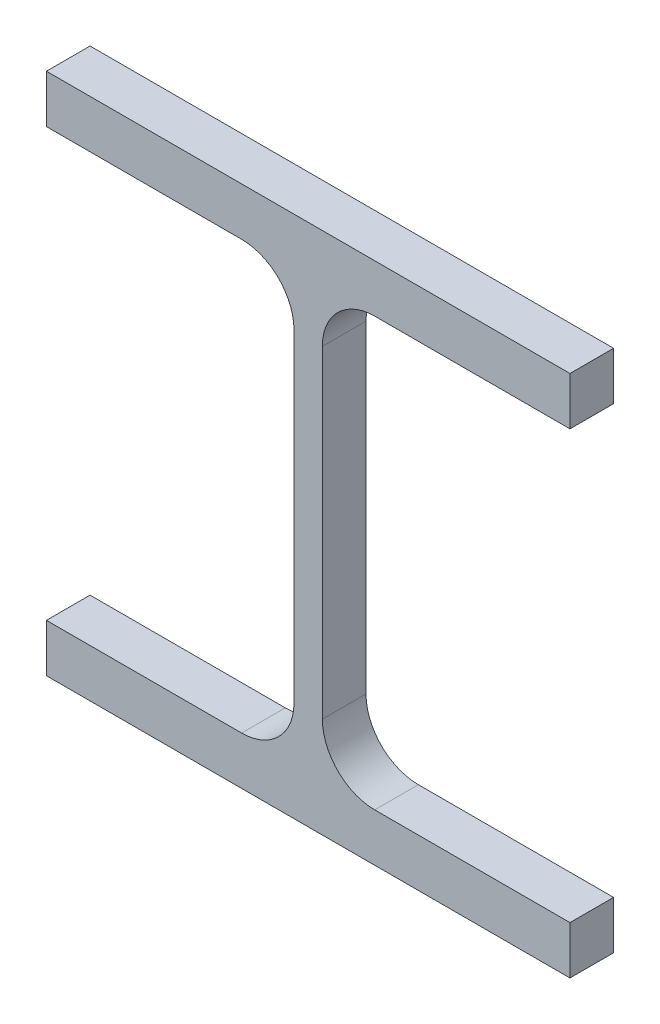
ISO-10303-21;
HEADER;
FILE_DESCRIPTION(('STEP AP214'),'2;1');
FILE_NAME('part.step','',(''),(''),'','','');
FILE_SCHEMA(('AUTOMOTIVE_DESIGN { 1 0 10303 214 1 1 1 1 }'));
ENDSEC;
DATA;
#1=APPLICATION_CONTEXT('core data for automotive mechanical design processes');
#2=APPLICATION_PROTOCOL_DEFINITION('international standard','automotive_design',2000,#1);
#3=PRODUCT_CONTEXT('',#1,'mechanical');
#4=PRODUCT('Part','Part','',(#3));
#5=PRODUCT_RELATED_PRODUCT_CATEGORY('part','',(#4));
#6=PRODUCT_DEFINITION_FORMATION('','',#4);
#7=PRODUCT_DEFINITION_CONTEXT('part definition',#1,'design');
#8=PRODUCT_DEFINITION('design','',#6,#7);
#9=PRODUCT_DEFINITION_SHAPE('','',#8);
#10=(LENGTH_UNIT() NAMED_UNIT(*) SI_UNIT(.MILLI.,.METRE.));
#11=(NAMED_UNIT(*) PLANE_ANGLE_UNIT() SI_UNIT($,.RADIAN.));
#12=(NAMED_UNIT(*) SI_UNIT($,.STERADIAN.) SOLID_ANGLE_UNIT());
#13=UNCERTAINTY_MEASURE_WITH_UNIT(LENGTH_MEASURE(1.E-05),#10,'distance_accuracy_value','');
#14=(GEOMETRIC_REPRESENTATION_CONTEXT(3) GLOBAL_UNCERTAINTY_ASSIGNED_CONTEXT((#13)) GLOBAL_UNIT_ASSIGNED_CONTEXT((#10,
#11,#12)) REPRESENTATION_CONTEXT('',''));
#15=CARTESIAN_POINT('',(0.,0.,0.));
#16=DIRECTION('',(0.,0.,1.));
#17=DIRECTION('',(1.,0.,0.));
#18=AXIS2_PLACEMENT_3D('',#15,#16,#17);
#19=CARTESIAN_POINT('',(-60.,-60.,10.));
#20=DIRECTION('',(1.,0.,0.));
#21=DIRECTION('',(0.,0.,-1.));
#22=AXIS2_PLACEMENT_3D('',#19,#20,#21);
#23=PLANE('',#22);
#24=DIRECTION('',(0.,-1.,0.));
#25=VECTOR('',#24,1.);
#26=CARTESIAN_POINT('',(-60.,-60.,0.));
#27=LINE('',#26,#25);
#28=CARTESIAN_POINT('',(-60.,-49.,0.));
#29=VERTEX_POINT('',#28);
#30=CARTESIAN_POINT('',(-60.,-60.,0.));
#31=VERTEX_POINT('',#30);
#32=EDGE_CURVE('E181',#29,#31,#27,.T.);
#33=ORIENTED_EDGE('',*,*,#32,.T.);
#34=DIRECTION('',(0.,0.,-1.));
#35=VECTOR('',#34,1.);
#36=CARTESIAN_POINT('',(-60.,-60.,10.));
#37=LINE('',#36,#35);
#38=CARTESIAN_POINT('',(-60.,-60.,10.));
#39=VERTEX_POINT('',#38);
#40=EDGE_CURVE('E11',#39,#31,#37,.T.);
#41=ORIENTED_EDGE('',*,*,#40,.F.);
#42=DIRECTION('',(0.,-1.,0.));
#43=VECTOR('',#42,1.);
#44=CARTESIAN_POINT('',(-60.,-60.,10.));
#45=LINE('',#44,#43);
#46=CARTESIAN_POINT('',(-60.,-49.,10.));
#47=VERTEX_POINT('',#46);
#48=EDGE_CURVE('E211',#47,#39,#45,.T.);
#49=ORIENTED_EDGE('',*,*,#48,.F.);
#50=DIRECTION('',(0.,0.,-1.));
#51=VECTOR('',#50,1.);
#52=CARTESIAN_POINT('',(-60.,-49.,10.));
#53=LINE('',#52,#51);
#54=EDGE_CURVE('E177',#47,#29,#53,.T.);
#55=ORIENTED_EDGE('',*,*,#54,.T.);
#56=EDGE_LOOP('',(#33,#41,#49,#55));
#57=FACE_BOUND('',#56,.T.);
#58=ADVANCED_FACE('F37',(#57),#23,.F.);
#59=CARTESIAN_POINT('',(60.,-60.,10.));
#60=DIRECTION('',(0.,1.,0.));
#61=DIRECTION('',(-1.,0.,0.));
#62=AXIS2_PLACEMENT_3D('',#59,#60,#61);
#63=PLANE('',#62);
#64=DIRECTION('',(1.,0.,0.));
#65=VECTOR('',#64,1.);
#66=CARTESIAN_POINT('',(60.,-60.,0.));
#67=LINE('',#66,#65);
#68=CARTESIAN_POINT('',(60.,-60.,0.));
#69=VERTEX_POINT('',#68);
#70=EDGE_CURVE('E184',#31,#69,#67,.T.);
#71=ORIENTED_EDGE('',*,*,#70,.T.);
#72=DIRECTION('',(0.,0.,-1.));
#73=VECTOR('',#72,1.);
#74=CARTESIAN_POINT('',(60.,-60.,10.));
#75=LINE('',#74,#73);
#76=CARTESIAN_POINT('',(60.,-60.,10.));
#77=VERTEX_POINT('',#76);
#78=EDGE_CURVE('E45',#77,#69,#75,.T.);
#79=ORIENTED_EDGE('',*,*,#78,.F.);
#80=DIRECTION('',(1.,0.,0.));
#81=VECTOR('',#80,1.);
#82=CARTESIAN_POINT('',(60.,-60.,10.));
#83=LINE('',#82,#81);
#84=EDGE_CURVE('E120',#39,#77,#83,.T.);
#85=ORIENTED_EDGE('',*,*,#84,.F.);
#86=ORIENTED_EDGE('',*,*,#40,.T.);
#87=EDGE_LOOP('',(#71,#79,#85,#86));
#88=FACE_BOUND('',#87,.T.);
#89=ADVANCED_FACE('F309',(#88),#63,.F.);
#90=CARTESIAN_POINT('',(60.,-60.,10.));
#91=DIRECTION('',(-1.,0.,0.));
#92=DIRECTION('',(0.,0.,1.));
#93=AXIS2_PLACEMENT_3D('',#90,#91,#92);
#94=PLANE('',#93);
#95=DIRECTION('',(0.,1.,0.));
#96=VECTOR('',#95,1.);
#97=CARTESIAN_POINT('',(60.,-60.,0.));
#98=LINE('',#97,#96);
#99=CARTESIAN_POINT('',(60.,-49.,0.));
#100=VERTEX_POINT('',#99);
#101=EDGE_CURVE('E186',#69,#100,#98,.T.);
#102=ORIENTED_EDGE('',*,*,#101,.T.);
#103=DIRECTION('',(0.,0.,-1.));
#104=VECTOR('',#103,1.);
#105=CARTESIAN_POINT('',(60.,-49.,10.));
#106=LINE('',#105,#104);
#107=CARTESIAN_POINT('',(60.,-49.,10.));
#108=VERTEX_POINT('',#107);
#109=EDGE_CURVE('E242',#108,#100,#106,.T.);
#110=ORIENTED_EDGE('',*,*,#109,.F.);
#111=DIRECTION('',(0.,1.,0.));
#112=VECTOR('',#111,1.);
#113=CARTESIAN_POINT('',(60.,-60.,10.));
#114=LINE('',#113,#112);
#115=EDGE_CURVE('E250',#77,#108,#114,.T.);
#116=ORIENTED_EDGE('',*,*,#115,.F.);
#117=ORIENTED_EDGE('',*,*,#78,.T.);
#118=EDGE_LOOP('',(#102,#110,#116,#117));
#119=FACE_BOUND('',#118,.T.);
#120=ADVANCED_FACE('F248',(#119),#94,.F.);
#121=CARTESIAN_POINT('',(60.,-49.,10.));
#122=DIRECTION('',(0.,-1.,0.));
#123=DIRECTION('',(1.,0.,0.));
#124=AXIS2_PLACEMENT_3D('',#121,#122,#123);
#125=PLANE('',#124);
#126=DIRECTION('',(-1.,0.,0.));
#127=VECTOR('',#126,1.);
#128=CARTESIAN_POINT('',(60.,-49.,0.));
#129=LINE('',#128,#127);
#130=CARTESIAN_POINT('',(15.25,-49.,0.));
#131=VERTEX_POINT('',#130);
#132=EDGE_CURVE('E188',#100,#131,#129,.T.);
#133=ORIENTED_EDGE('',*,*,#132,.T.);
#134=DIRECTION('',(0.,0.,-1.));
#135=VECTOR('',#134,1.);
#136=CARTESIAN_POINT('',(15.25,-49.,10.));
#137=LINE('',#136,#135);
#138=CARTESIAN_POINT('',(15.25,-49.,10.));
#139=VERTEX_POINT('',#138);
#140=EDGE_CURVE('E239',#139,#131,#137,.T.);
#141=ORIENTED_EDGE('',*,*,#140,.F.);
#142=DIRECTION('',(-1.,0.,0.));
#143=VECTOR('',#142,1.);
#144=CARTESIAN_POINT('',(60.,-49.,10.));
#145=LINE('',#144,#143);
#146=EDGE_CURVE('E268',#108,#139,#145,.T.);
#147=ORIENTED_EDGE('',*,*,#146,.F.);
#148=ORIENTED_EDGE('',*,*,#109,.T.);
#149=EDGE_LOOP('',(#133,#141,#147,#148));
#150=FACE_BOUND('',#149,.T.);
#151=ADVANCED_FACE('F259',(#150),#125,.F.);
#152=CARTESIAN_POINT('',(15.25,-37.,10.));
#153=DIRECTION('',(0.,0.,-1.));
#154=DIRECTION('',(-1.,0.,0.));
#155=AXIS2_PLACEMENT_3D('',#152,#153,#154);
#156=CYLINDRICAL_SURFACE('',#155,12.);
#157=CARTESIAN_POINT('',(15.25,-37.,0.));
#158=DIRECTION('',(0.,0.,-1.));
#159=DIRECTION('',(-1.,0.,0.));
#160=AXIS2_PLACEMENT_3D('',#157,#158,#159);
#161=CIRCLE('',#160,12.);
#162=CARTESIAN_POINT('',(3.25,-37.,0.));
#163=VERTEX_POINT('',#162);
#164=EDGE_CURVE('E190',#131,#163,#161,.T.);
#165=ORIENTED_EDGE('',*,*,#164,.T.);
#166=DIRECTION('',(0.,0.,-1.));
#167=VECTOR('',#166,1.);
#168=CARTESIAN_POINT('',(3.25,-37.,10.));
#169=LINE('',#168,#167);
#170=CARTESIAN_POINT('',(3.25,-37.,10.));
#171=VERTEX_POINT('',#170);
#172=EDGE_CURVE('E236',#171,#163,#169,.T.);
#173=ORIENTED_EDGE('',*,*,#172,.F.);
#174=CARTESIAN_POINT('',(15.25,-37.,10.));
#175=DIRECTION('',(0.,0.,-1.));
#176=DIRECTION('',(-1.,0.,0.));
#177=AXIS2_PLACEMENT_3D('',#174,#175,#176);
#178=CIRCLE('',#177,12.);
#179=EDGE_CURVE('E265',#139,#171,#178,.T.);
#180=ORIENTED_EDGE('',*,*,#179,.F.);
#181=ORIENTED_EDGE('',*,*,#140,.T.);
#182=EDGE_LOOP('',(#165,#173,#180,#181));
#183=FACE_BOUND('',#182,.T.);
#184=ADVANCED_FACE('F263',(#183),#156,.F.);
#185=CARTESIAN_POINT('',(3.24999999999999,-37.,10.));
#186=DIRECTION('',(-1.,0.,0.));
#187=DIRECTION('',(0.,0.,1.));
#188=AXIS2_PLACEMENT_3D('',#185,#186,#187);
#189=PLANE('',#188);
#190=DIRECTION('',(0.,1.,0.));
#191=VECTOR('',#190,1.);
#192=CARTESIAN_POINT('',(3.24999999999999,-37.,0.));
#193=LINE('',#192,#191);
#194=CARTESIAN_POINT('',(3.24999999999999,37.,0.));
#195=VERTEX_POINT('',#194);
#196=EDGE_CURVE('E192',#163,#195,#193,.T.);
#197=ORIENTED_EDGE('',*,*,#196,.T.);
#198=DIRECTION('',(0.,0.,-1.));
#199=VECTOR('',#198,1.);
#200=CARTESIAN_POINT('',(3.24999999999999,37.,10.));
#201=LINE('',#200,#199);
#202=CARTESIAN_POINT('',(3.24999999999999,37.,10.));
#203=VERTEX_POINT('',#202);
#204=EDGE_CURVE('E233',#203,#195,#201,.T.);
#205=ORIENTED_EDGE('',*,*,#204,.F.);
#206=DIRECTION('',(0.,1.,0.));
#207=VECTOR('',#206,1.);
#208=CARTESIAN_POINT('',(3.24999999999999,-37.,10.));
#209=LINE('',#208,#207);
#210=EDGE_CURVE('E267',#171,#203,#209,.T.);
#211=ORIENTED_EDGE('',*,*,#210,.F.);
#212=ORIENTED_EDGE('',*,*,#172,.T.);
#213=EDGE_LOOP('',(#197,#205,#211,#212));
#214=FACE_BOUND('',#213,.T.);
#215=ADVANCED_FACE('F322',(#214),#189,.F.);
#216=CARTESIAN_POINT('',(15.25,37.,10.));
#217=DIRECTION('',(0.,0.,-1.));
#218=DIRECTION('',(-1.,0.,0.));
#219=AXIS2_PLACEMENT_3D('',#216,#217,#218);
#220=CYLINDRICAL_SURFACE('',#219,12.);
#221=CARTESIAN_POINT('',(15.25,37.,0.));
#222=DIRECTION('',(0.,0.,-1.));
#223=DIRECTION('',(-1.,0.,0.));
#224=AXIS2_PLACEMENT_3D('',#221,#222,#223);
#225=CIRCLE('',#224,12.);
#226=CARTESIAN_POINT('',(15.25,49.,0.));
#227=VERTEX_POINT('',#226);
#228=EDGE_CURVE('E194',#195,#227,#225,.T.);
#229=ORIENTED_EDGE('',*,*,#228,.T.);
#230=DIRECTION('',(0.,0.,-1.));
#231=VECTOR('',#230,1.);
#232=CARTESIAN_POINT('',(15.25,49.,10.));
#233=LINE('',#232,#231);
#234=CARTESIAN_POINT('',(15.25,49.,10.));
#235=VERTEX_POINT('',#234);
#236=EDGE_CURVE('E230',#235,#227,#233,.T.);
#237=ORIENTED_EDGE('',*,*,#236,.F.);
#238=CARTESIAN_POINT('',(15.25,37.,10.));
#239=DIRECTION('',(0.,0.,-1.));
#240=DIRECTION('',(-1.,0.,0.));
#241=AXIS2_PLACEMENT_3D('',#238,#239,#240);
#242=CIRCLE('',#241,12.);
#243=EDGE_CURVE('E270',#203,#235,#242,.T.);
#244=ORIENTED_EDGE('',*,*,#243,.F.);
#245=ORIENTED_EDGE('',*,*,#204,.T.);
#246=EDGE_LOOP('',(#229,#237,#244,#245));
#247=FACE_BOUND('',#246,.T.);
#248=ADVANCED_FACE('F325',(#247),#220,.F.);
#249=CARTESIAN_POINT('',(15.25,49.,10.));
#250=DIRECTION('',(0.,1.,0.));
#251=DIRECTION('',(-1.,0.,0.));
#252=AXIS2_PLACEMENT_3D('',#249,#250,#251);
#253=PLANE('',#252);
#254=DIRECTION('',(1.,0.,0.));
#255=VECTOR('',#254,1.);
#256=CARTESIAN_POINT('',(15.25,49.,0.));
#257=LINE('',#256,#255);
#258=CARTESIAN_POINT('',(60.,49.,0.));
#259=VERTEX_POINT('',#258);
#260=EDGE_CURVE('E196',#227,#259,#257,.T.);
#261=ORIENTED_EDGE('',*,*,#260,.T.);
#262=DIRECTION('',(0.,0.,-1.));
#263=VECTOR('',#262,1.);
#264=CARTESIAN_POINT('',(60.,49.,10.));
#265=LINE('',#264,#263);
#266=CARTESIAN_POINT('',(60.,49.,10.));
#267=VERTEX_POINT('',#266);
#268=EDGE_CURVE('E227',#267,#259,#265,.T.);
#269=ORIENTED_EDGE('',*,*,#268,.F.);
#270=DIRECTION('',(1.,0.,0.));
#271=VECTOR('',#270,1.);
#272=CARTESIAN_POINT('',(15.25,49.,10.));
#273=LINE('',#272,#271);
#274=EDGE_CURVE('E276',#235,#267,#273,.T.);
#275=ORIENTED_EDGE('',*,*,#274,.F.);
#276=ORIENTED_EDGE('',*,*,#236,.T.);
#277=EDGE_LOOP('',(#261,#269,#275,#276));
#278=FACE_BOUND('',#277,.T.);
#279=ADVANCED_FACE('F329',(#278),#253,.F.);
#280=CARTESIAN_POINT('',(60.,49.,10.));
#281=DIRECTION('',(-1.,0.,0.));
#282=DIRECTION('',(0.,0.,1.));
#283=AXIS2_PLACEMENT_3D('',#280,#281,#282);
#284=PLANE('',#283);
#285=DIRECTION('',(0.,1.,0.));
#286=VECTOR('',#285,1.);
#287=CARTESIAN_POINT('',(60.,49.,0.));
#288=LINE('',#287,#286);
#289=CARTESIAN_POINT('',(60.,60.,0.));
#290=VERTEX_POINT('',#289);
#291=EDGE_CURVE('E198',#259,#290,#288,.T.);
#292=ORIENTED_EDGE('',*,*,#291,.T.);
#293=DIRECTION('',(0.,0.,-1.));
#294=VECTOR('',#293,1.);
#295=CARTESIAN_POINT('',(60.,60.,10.));
#296=LINE('',#295,#294);
#297=CARTESIAN_POINT('',(60.,60.,10.));
#298=VERTEX_POINT('',#297);
#299=EDGE_CURVE('E224',#298,#290,#296,.T.);
#300=ORIENTED_EDGE('',*,*,#299,.F.);
#301=DIRECTION('',(0.,1.,0.));
#302=VECTOR('',#301,1.);
#303=CARTESIAN_POINT('',(60.,49.,10.));
#304=LINE('',#303,#302);
#305=EDGE_CURVE('E278',#267,#298,#304,.T.);
#306=ORIENTED_EDGE('',*,*,#305,.F.);
#307=ORIENTED_EDGE('',*,*,#268,.T.);
#308=EDGE_LOOP('',(#292,#300,#306,#307));
#309=FACE_BOUND('',#308,.T.);
#310=ADVANCED_FACE('F333',(#309),#284,.F.);
#311=CARTESIAN_POINT('',(-60.,60.,10.));
#312=DIRECTION('',(0.,-1.,0.));
#313=DIRECTION('',(1.,0.,0.));
#314=AXIS2_PLACEMENT_3D('',#311,#312,#313);
#315=PLANE('',#314);
#316=DIRECTION('',(-1.,0.,0.));
#317=VECTOR('',#316,1.);
#318=CARTESIAN_POINT('',(-60.,60.,0.));
#319=LINE('',#318,#317);
#320=CARTESIAN_POINT('',(-60.,60.,0.));
#321=VERTEX_POINT('',#320);
#322=EDGE_CURVE('E200',#290,#321,#319,.T.);
#323=ORIENTED_EDGE('',*,*,#322,.T.);
#324=DIRECTION('',(0.,0.,-1.));
#325=VECTOR('',#324,1.);
#326=CARTESIAN_POINT('',(-60.,60.,10.));
#327=LINE('',#326,#325);
#328=CARTESIAN_POINT('',(-60.,60.,10.));
#329=VERTEX_POINT('',#328);
#330=EDGE_CURVE('E221',#329,#321,#327,.T.);
#331=ORIENTED_EDGE('',*,*,#330,.F.);
#332=DIRECTION('',(-1.,0.,0.));
#333=VECTOR('',#332,1.);
#334=CARTESIAN_POINT('',(-60.,60.,10.));
#335=LINE('',#334,#333);
#336=EDGE_CURVE('E280',#298,#329,#335,.T.);
#337=ORIENTED_EDGE('',*,*,#336,.F.);
#338=ORIENTED_EDGE('',*,*,#299,.T.);
#339=EDGE_LOOP('',(#323,#331,#337,#338));
#340=FACE_BOUND('',#339,.T.);
#341=ADVANCED_FACE('F337',(#340),#315,.F.);
#342=CARTESIAN_POINT('',(-60.,49.,10.));
#343=DIRECTION('',(1.,0.,0.));
#344=DIRECTION('',(0.,0.,-1.));
#345=AXIS2_PLACEMENT_3D('',#342,#343,#344);
#346=PLANE('',#345);
#347=DIRECTION('',(0.,-1.,0.));
#348=VECTOR('',#347,1.);
#349=CARTESIAN_POINT('',(-60.,49.,0.));
#350=LINE('',#349,#348);
#351=CARTESIAN_POINT('',(-60.,49.,0.));
#352=VERTEX_POINT('',#351);
#353=EDGE_CURVE('E202',#321,#352,#350,.T.);
#354=ORIENTED_EDGE('',*,*,#353,.T.);
#355=DIRECTION('',(0.,0.,-1.));
#356=VECTOR('',#355,1.);
#357=CARTESIAN_POINT('',(-60.,49.,10.));
#358=LINE('',#357,#356);
#359=CARTESIAN_POINT('',(-60.,49.,10.));
#360=VERTEX_POINT('',#359);
#361=EDGE_CURVE('E218',#360,#352,#358,.T.);
#362=ORIENTED_EDGE('',*,*,#361,.F.);
#363=DIRECTION('',(0.,-1.,0.));
#364=VECTOR('',#363,1.);
#365=CARTESIAN_POINT('',(-60.,49.,10.));
#366=LINE('',#365,#364);
#367=EDGE_CURVE('E282',#329,#360,#366,.T.);
#368=ORIENTED_EDGE('',*,*,#367,.F.);
#369=ORIENTED_EDGE('',*,*,#330,.T.);
#370=EDGE_LOOP('',(#354,#362,#368,#369));
#371=FACE_BOUND('',#370,.T.);
#372=ADVANCED_FACE('F341',(#371),#346,.F.);
#373=CARTESIAN_POINT('',(-15.25,49.,10.));
#374=DIRECTION('',(0.,1.,0.));
#375=DIRECTION('',(0.,0.,1.));
#376=AXIS2_PLACEMENT_3D('',#373,#374,#375);
#377=PLANE('',#376);
#378=DIRECTION('',(1.,0.,0.));
#379=VECTOR('',#378,1.);
#380=CARTESIAN_POINT('',(-15.25,49.,0.));
#381=LINE('',#380,#379);
#382=CARTESIAN_POINT('',(-15.25,49.,0.));
#383=VERTEX_POINT('',#382);
#384=EDGE_CURVE('E204',#352,#383,#381,.T.);
#385=ORIENTED_EDGE('',*,*,#384,.T.);
#386=DIRECTION('',(0.,0.,-1.));
#387=VECTOR('',#386,1.);
#388=CARTESIAN_POINT('',(-15.25,49.,10.));
#389=LINE('',#388,#387);
#390=CARTESIAN_POINT('',(-15.25,49.,10.));
#391=VERTEX_POINT('',#390);
#392=EDGE_CURVE('E215',#391,#383,#389,.T.);
#393=ORIENTED_EDGE('',*,*,#392,.F.);
#394=DIRECTION('',(1.,0.,0.));
#395=VECTOR('',#394,1.);
#396=CARTESIAN_POINT('',(-15.25,49.,10.));
#397=LINE('',#396,#395);
#398=EDGE_CURVE('E284',#360,#391,#397,.T.);
#399=ORIENTED_EDGE('',*,*,#398,.F.);
#400=ORIENTED_EDGE('',*,*,#361,.T.);
#401=EDGE_LOOP('',(#385,#393,#399,#400));
#402=FACE_BOUND('',#401,.T.);
#403=ADVANCED_FACE('F290',(#402),#377,.F.);
#404=CARTESIAN_POINT('',(-15.25,37.,10.));
#405=DIRECTION('',(0.,0.,-1.));
#406=DIRECTION('',(-1.,0.,0.));
#407=AXIS2_PLACEMENT_3D('',#404,#405,#406);
#408=CYLINDRICAL_SURFACE('',#407,12.);
#409=CARTESIAN_POINT('',(-15.25,37.,0.));
#410=DIRECTION('',(0.,0.,-1.));
#411=DIRECTION('',(1.,0.,0.));
#412=AXIS2_PLACEMENT_3D('',#409,#410,#411);
#413=CIRCLE('',#412,12.);
#414=CARTESIAN_POINT('',(-3.24999999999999,37.,0.));
#415=VERTEX_POINT('',#414);
#416=EDGE_CURVE('E206',#383,#415,#413,.T.);
#417=ORIENTED_EDGE('',*,*,#416,.T.);
#418=DIRECTION('',(0.,0.,-1.));
#419=VECTOR('',#418,1.);
#420=CARTESIAN_POINT('',(-3.24999999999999,37.,10.));
#421=LINE('',#420,#419);
#422=CARTESIAN_POINT('',(-3.24999999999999,37.,10.));
#423=VERTEX_POINT('',#422);
#424=EDGE_CURVE('E172',#423,#415,#421,.T.);
#425=ORIENTED_EDGE('',*,*,#424,.F.);
#426=CARTESIAN_POINT('',(-15.25,37.,10.));
#427=DIRECTION('',(0.,0.,-1.));
#428=DIRECTION('',(1.,0.,0.));
#429=AXIS2_PLACEMENT_3D('',#426,#427,#428);
#430=CIRCLE('',#429,12.);
#431=EDGE_CURVE('E163',#391,#423,#430,.T.);
#432=ORIENTED_EDGE('',*,*,#431,.F.);
#433=ORIENTED_EDGE('',*,*,#392,.T.);
#434=EDGE_LOOP('',(#417,#425,#432,#433));
#435=FACE_BOUND('',#434,.T.);
#436=ADVANCED_FACE('F294',(#435),#408,.F.);
#437=CARTESIAN_POINT('',(-3.24999999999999,-37.,10.));
#438=DIRECTION('',(1.,0.,0.));
#439=DIRECTION('',(0.,0.,-1.));
#440=AXIS2_PLACEMENT_3D('',#437,#438,#439);
#441=PLANE('',#440);
#442=DIRECTION('',(0.,-1.,0.));
#443=VECTOR('',#442,1.);
#444=CARTESIAN_POINT('',(-3.24999999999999,-37.,0.));
#445=LINE('',#444,#443);
#446=CARTESIAN_POINT('',(-3.24999999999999,-37.,0.));
#447=VERTEX_POINT('',#446);
#448=EDGE_CURVE('E171',#415,#447,#445,.T.);
#449=ORIENTED_EDGE('',*,*,#448,.T.);
#450=DIRECTION('',(0.,0.,-1.));
#451=VECTOR('',#450,1.);
#452=CARTESIAN_POINT('',(-3.24999999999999,-37.,10.));
#453=LINE('',#452,#451);
#454=CARTESIAN_POINT('',(-3.24999999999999,-37.,10.));
#455=VERTEX_POINT('',#454);
#456=EDGE_CURVE('E168',#455,#447,#453,.T.);
#457=ORIENTED_EDGE('',*,*,#456,.F.);
#458=DIRECTION('',(0.,-1.,0.));
#459=VECTOR('',#458,1.);
#460=CARTESIAN_POINT('',(-3.24999999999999,-37.,10.));
#461=LINE('',#460,#459);
#462=EDGE_CURVE('E157',#423,#455,#461,.T.);
#463=ORIENTED_EDGE('',*,*,#462,.F.);
#464=ORIENTED_EDGE('',*,*,#424,.T.);
#465=EDGE_LOOP('',(#449,#457,#463,#464));
#466=FACE_BOUND('',#465,.T.);
#467=ADVANCED_FACE('F169',(#466),#441,.F.);
#468=CARTESIAN_POINT('',(-15.25,-37.,10.));
#469=DIRECTION('',(0.,0.,-1.));
#470=DIRECTION('',(-1.,0.,0.));
#471=AXIS2_PLACEMENT_3D('',#468,#469,#470);
#472=CYLINDRICAL_SURFACE('',#471,12.);
#473=CARTESIAN_POINT('',(-15.25,-37.,0.));
#474=DIRECTION('',(0.,0.,-1.));
#475=DIRECTION('',(1.,0.,0.));
#476=AXIS2_PLACEMENT_3D('',#473,#474,#475);
#477=CIRCLE('',#476,12.);
#478=CARTESIAN_POINT('',(-15.25,-49.,0.));
#479=VERTEX_POINT('',#478);
#480=EDGE_CURVE('E106',#447,#479,#477,.T.);
#481=ORIENTED_EDGE('',*,*,#480,.T.);
#482=DIRECTION('',(0.,0.,-1.));
#483=VECTOR('',#482,1.);
#484=CARTESIAN_POINT('',(-15.25,-49.,10.));
#485=LINE('',#484,#483);
#486=CARTESIAN_POINT('',(-15.25,-49.,10.));
#487=VERTEX_POINT('',#486);
#488=EDGE_CURVE('E173',#487,#479,#485,.T.);
#489=ORIENTED_EDGE('',*,*,#488,.F.);
#490=CARTESIAN_POINT('',(-15.25,-37.,10.));
#491=DIRECTION('',(0.,0.,-1.));
#492=DIRECTION('',(1.,0.,0.));
#493=AXIS2_PLACEMENT_3D('',#490,#491,#492);
#494=CIRCLE('',#493,12.);
#495=EDGE_CURVE('E161',#455,#487,#494,.T.);
#496=ORIENTED_EDGE('',*,*,#495,.F.);
#497=ORIENTED_EDGE('',*,*,#456,.T.);
#498=EDGE_LOOP('',(#481,#489,#496,#497));
#499=FACE_BOUND('',#498,.T.);
#500=ADVANCED_FACE('F175',(#499),#472,.F.);
#501=CARTESIAN_POINT('',(-60.,-49.,10.));
#502=DIRECTION('',(0.,-1.,0.));
#503=DIRECTION('',(0.,0.,-1.));
#504=AXIS2_PLACEMENT_3D('',#501,#502,#503);
#505=PLANE('',#504);
#506=DIRECTION('',(-1.,0.,0.));
#507=VECTOR('',#506,1.);
#508=CARTESIAN_POINT('',(-60.,-49.,0.));
#509=LINE('',#508,#507);
#510=EDGE_CURVE('E112',#479,#29,#509,.T.);
#511=ORIENTED_EDGE('',*,*,#510,.T.);
#512=ORIENTED_EDGE('',*,*,#54,.F.);
#513=DIRECTION('',(-1.,0.,0.));
#514=VECTOR('',#513,1.);
#515=CARTESIAN_POINT('',(-60.,-49.,10.));
#516=LINE('',#515,#514);
#517=EDGE_CURVE('E53',#487,#47,#516,.T.);
#518=ORIENTED_EDGE('',*,*,#517,.F.);
#519=ORIENTED_EDGE('',*,*,#488,.T.);
#520=EDGE_LOOP('',(#511,#512,#518,#519));
#521=FACE_BOUND('',#520,.T.);
#522=ADVANCED_FACE('F298',(#521),#505,.F.);
#523=CARTESIAN_POINT('',(-15.25,-37.,10.));
#524=DIRECTION('',(0.,0.,1.));
#525=DIRECTION('',(1.,0.,0.));
#526=AXIS2_PLACEMENT_3D('',#523,#524,#525);
#527=PLANE('',#526);
#528=ORIENTED_EDGE('',*,*,#48,.T.);
#529=ORIENTED_EDGE('',*,*,#84,.T.);
#530=ORIENTED_EDGE('',*,*,#115,.T.);
#531=ORIENTED_EDGE('',*,*,#146,.T.);
#532=ORIENTED_EDGE('',*,*,#179,.T.);
#533=ORIENTED_EDGE('',*,*,#210,.T.);
#534=ORIENTED_EDGE('',*,*,#243,.T.);
#535=ORIENTED_EDGE('',*,*,#274,.T.);
#536=ORIENTED_EDGE('',*,*,#305,.T.);
#537=ORIENTED_EDGE('',*,*,#336,.T.);
#538=ORIENTED_EDGE('',*,*,#367,.T.);
#539=ORIENTED_EDGE('',*,*,#398,.T.);
#540=ORIENTED_EDGE('',*,*,#431,.T.);
#541=ORIENTED_EDGE('',*,*,#462,.T.);
#542=ORIENTED_EDGE('',*,*,#495,.T.);
#543=ORIENTED_EDGE('',*,*,#517,.T.);
#544=EDGE_LOOP('',(#528,#529,#530,#531,#532,#533,#534,#535,#536,#537,#538,#539,#540,#541,#542,#543));
#545=FACE_BOUND('',#544,.T.);
#546=ADVANCED_FACE('F159',(#545),#527,.T.);
#547=CARTESIAN_POINT('',(-15.25,-37.,0.));
#548=DIRECTION('',(0.,0.,1.));
#549=DIRECTION('',(1.,0.,0.));
#550=AXIS2_PLACEMENT_3D('',#547,#548,#549);
#551=PLANE('',#550);
#552=ORIENTED_EDGE('',*,*,#32,.F.);
#553=ORIENTED_EDGE('',*,*,#510,.F.);
#554=ORIENTED_EDGE('',*,*,#480,.F.);
#555=ORIENTED_EDGE('',*,*,#448,.F.);
#556=ORIENTED_EDGE('',*,*,#416,.F.);
#557=ORIENTED_EDGE('',*,*,#384,.F.);
#558=ORIENTED_EDGE('',*,*,#353,.F.);
#559=ORIENTED_EDGE('',*,*,#322,.F.);
#560=ORIENTED_EDGE('',*,*,#291,.F.);
#561=ORIENTED_EDGE('',*,*,#260,.F.);
#562=ORIENTED_EDGE('',*,*,#228,.F.);
#563=ORIENTED_EDGE('',*,*,#196,.F.);
#564=ORIENTED_EDGE('',*,*,#164,.F.);
#565=ORIENTED_EDGE('',*,*,#132,.F.);
#566=ORIENTED_EDGE('',*,*,#101,.F.);
#567=ORIENTED_EDGE('',*,*,#70,.F.);
#568=EDGE_LOOP('',(#552,#553,#554,#555,#556,#557,#558,#559,#560,#561,#562,#563,#564,#565,#566,#567));
#569=FACE_BOUND('',#568,.T.);
#570=ADVANCED_FACE('F254',(#569),#551,.F.);
#571=CLOSED_SHELL('',(#58,#89,#120,#151,#184,#215,#248,#279,#310,#341,#372,#403,#436,#467,#500,
#522,#546,#570));
#572=MANIFOLD_SOLID_BREP('B2',#571);
#573=ADVANCED_BREP_SHAPE_REPRESENTATION('',(#18,#572),#14);
#574=SHAPE_DEFINITION_REPRESENTATION(#9,#573);
ENDSEC;
END-ISO-10303-21;
